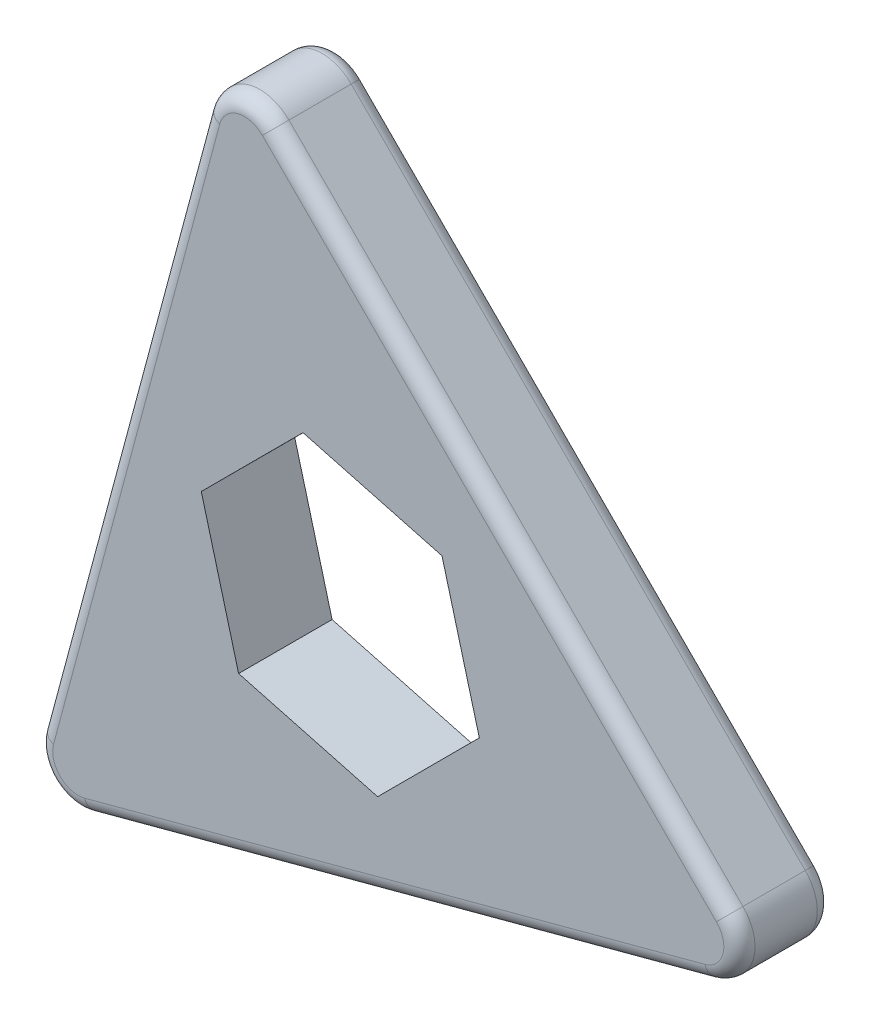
from build123d import *

# Parameters (mm, degrees)
BASE_EXTRUSION_DEPTH = 3
CONG_1_R             = 0.5


with BuildPart() as part:
    # Esquisse1 → Base-Extrusion (new body)
    with BuildSketch(Plane.XY):
        with BuildLine():
            Line((-2.148722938, 12.424254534), (12.424254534, -2.148722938))
            ThreePointArc((12.424254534, -2.148722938), (12.764991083, -3.420369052), (11.834081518, -4.351278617))
            Line((11.834081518, -4.351278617), (-8.072975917, -9.68535858))
            ThreePointArc((-8.072975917, -9.68535858), (-9.344622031, -9.344622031), (-9.68535858, -8.072975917))
            Line((-9.68535858, -8.072975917), (-4.351278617, 11.834081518))
            ThreePointArc((-4.351278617, 11.834081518), (-3.420369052, 12.764991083), (-2.148722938, 12.424254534))
        make_face()
        Polygon((1.198024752, -4.46072528), (4.462113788, -1.192842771), (3.264089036, 3.267882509), (-1.198024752, 4.46072528), (-4.462113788, 1.192842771), (-3.264089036, -3.267882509), align=None, mode=Mode.SUBTRACT)
    extrude(amount=BASE_EXTRUSION_DEPTH)

    # Cong_1
    cong_1_edges = [part.edges().sort_by_distance(p)[0] for p in [
        (5.137765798, 5.137765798, 0),
        (5.137765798, 5.137765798, 3),
        (12.764991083, -3.420369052, 0),
        (12.764991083, -3.420369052, 3),
        (1.880552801, -7.018318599, 0),
        (1.880552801, -7.018318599, 3),
        (-9.344622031, -9.344622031, 0),
        (-9.344622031, -9.344622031, 3),
        (-7.018318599, 1.880552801, 0),
        (-7.018318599, 1.880552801, 3),
        (-3.420369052, 12.764991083, 0),
        (-3.420369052, 12.764991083, 3),
    ]]
    fillet(cong_1_edges, radius=CONG_1_R)


solid = part.part
